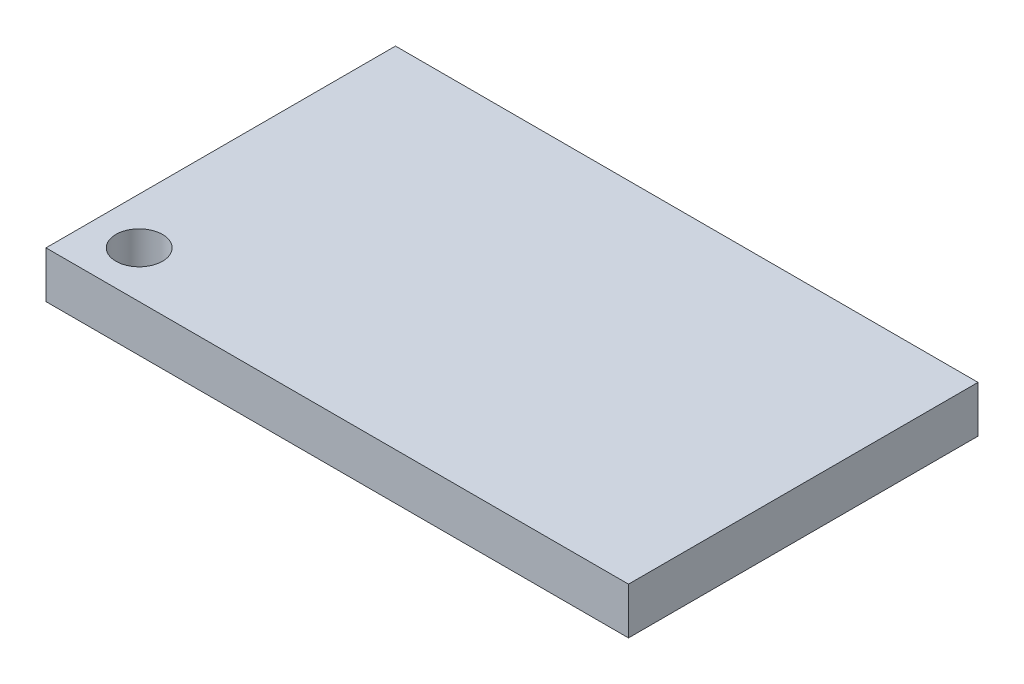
from build123d import *

# Parameters (mm, degrees)
SKETCH1_W          = 125
SKETCH1_H          = 75
EXTRUDE1_DEPTH     = 10
SKETCH2_R          = 5
CUT_EXTRUDE1_DEPTH = 10


with BuildPart() as part:
    # Sketch1 → Extrude1 (new body)
    with BuildSketch(Plane(origin=(0, 0, 0), x_dir=(1, 0, 0), z_dir=(0, 1, 0))):
        with Locations((62.5, 37.5)):
            Rectangle(SKETCH1_W, SKETCH1_H)
    extrude(amount=EXTRUDE1_DEPTH)

    # Sketch2 → Cut-Extrude1 (cut)
    with BuildSketch(Plane(origin=(0, 10, 0), x_dir=(-1, 0, 0), z_dir=(0, 1, 0))):
        with Locations(Location((-10, -10, 0), (0, 0, 90))):
            Circle(SKETCH2_R)
    extrude(amount=-CUT_EXTRUDE1_DEPTH, mode=Mode.SUBTRACT)


solid = part.part
